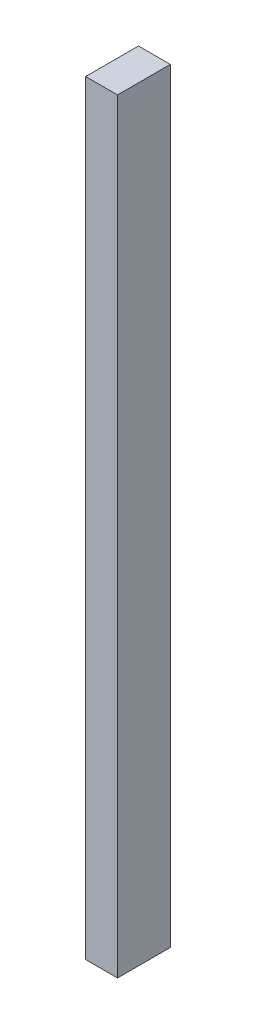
ISO-10303-21;
HEADER;
FILE_DESCRIPTION(('STEP AP214'),'2;1');
FILE_NAME('part.step','',(''),(''),'','','');
FILE_SCHEMA(('AUTOMOTIVE_DESIGN { 1 0 10303 214 1 1 1 1 }'));
ENDSEC;
DATA;
#1=APPLICATION_CONTEXT('core data for automotive mechanical design processes');
#2=APPLICATION_PROTOCOL_DEFINITION('international standard','automotive_design',2000,#1);
#3=PRODUCT_CONTEXT('',#1,'mechanical');
#4=PRODUCT('Part','Part','',(#3));
#5=PRODUCT_RELATED_PRODUCT_CATEGORY('part','',(#4));
#6=PRODUCT_DEFINITION_FORMATION('','',#4);
#7=PRODUCT_DEFINITION_CONTEXT('part definition',#1,'design');
#8=PRODUCT_DEFINITION('design','',#6,#7);
#9=PRODUCT_DEFINITION_SHAPE('','',#8);
#10=(LENGTH_UNIT() NAMED_UNIT(*) SI_UNIT(.MILLI.,.METRE.));
#11=(NAMED_UNIT(*) PLANE_ANGLE_UNIT() SI_UNIT($,.RADIAN.));
#12=(NAMED_UNIT(*) SI_UNIT($,.STERADIAN.) SOLID_ANGLE_UNIT());
#13=UNCERTAINTY_MEASURE_WITH_UNIT(LENGTH_MEASURE(1.E-05),#10,'distance_accuracy_value','');
#14=(GEOMETRIC_REPRESENTATION_CONTEXT(3) GLOBAL_UNCERTAINTY_ASSIGNED_CONTEXT((#13)) GLOBAL_UNIT_ASSIGNED_CONTEXT((#10,
#11,#12)) REPRESENTATION_CONTEXT('',''));
#15=CARTESIAN_POINT('',(0.,0.,0.));
#16=DIRECTION('',(0.,0.,1.));
#17=DIRECTION('',(1.,0.,0.));
#18=AXIS2_PLACEMENT_3D('',#15,#16,#17);
#19=CARTESIAN_POINT('',(0.,0.,63.));
#20=DIRECTION('',(1.,0.,0.));
#21=DIRECTION('',(0.,0.,-1.));
#22=AXIS2_PLACEMENT_3D('',#19,#20,#21);
#23=PLANE('',#22);
#24=DIRECTION('',(0.,-1.,0.));
#25=VECTOR('',#24,1.);
#26=CARTESIAN_POINT('',(0.,0.,0.));
#27=LINE('',#26,#25);
#28=CARTESIAN_POINT('',(0.,912.,0.));
#29=VERTEX_POINT('',#28);
#30=CARTESIAN_POINT('',(0.,0.,0.));
#31=VERTEX_POINT('',#30);
#32=EDGE_CURVE('E96',#29,#31,#27,.T.);
#33=ORIENTED_EDGE('',*,*,#32,.T.);
#34=DIRECTION('',(0.,0.,-1.));
#35=VECTOR('',#34,1.);
#36=CARTESIAN_POINT('',(0.,0.,63.));
#37=LINE('',#36,#35);
#38=CARTESIAN_POINT('',(0.,0.,63.));
#39=VERTEX_POINT('',#38);
#40=EDGE_CURVE('E11',#39,#31,#37,.T.);
#41=ORIENTED_EDGE('',*,*,#40,.F.);
#42=DIRECTION('',(0.,-1.,0.));
#43=VECTOR('',#42,1.);
#44=CARTESIAN_POINT('',(0.,0.,63.));
#45=LINE('',#44,#43);
#46=CARTESIAN_POINT('',(0.,912.,63.));
#47=VERTEX_POINT('',#46);
#48=EDGE_CURVE('E84',#47,#39,#45,.T.);
#49=ORIENTED_EDGE('',*,*,#48,.F.);
#50=DIRECTION('',(0.,0.,-1.));
#51=VECTOR('',#50,1.);
#52=CARTESIAN_POINT('',(0.,912.,63.));
#53=LINE('',#52,#51);
#54=EDGE_CURVE('E92',#47,#29,#53,.T.);
#55=ORIENTED_EDGE('',*,*,#54,.T.);
#56=EDGE_LOOP('',(#33,#41,#49,#55));
#57=FACE_BOUND('',#56,.T.);
#58=ADVANCED_FACE('F33',(#57),#23,.F.);
#59=CARTESIAN_POINT('',(0.,0.,63.));
#60=DIRECTION('',(0.,1.,0.));
#61=DIRECTION('',(0.,0.,1.));
#62=AXIS2_PLACEMENT_3D('',#59,#60,#61);
#63=PLANE('',#62);
#64=DIRECTION('',(1.,0.,0.));
#65=VECTOR('',#64,1.);
#66=CARTESIAN_POINT('',(0.,0.,0.));
#67=LINE('',#66,#65);
#68=CARTESIAN_POINT('',(38.,0.,0.));
#69=VERTEX_POINT('',#68);
#70=EDGE_CURVE('E88',#31,#69,#67,.T.);
#71=ORIENTED_EDGE('',*,*,#70,.T.);
#72=DIRECTION('',(0.,0.,-1.));
#73=VECTOR('',#72,1.);
#74=CARTESIAN_POINT('',(38.,0.,63.));
#75=LINE('',#74,#73);
#76=CARTESIAN_POINT('',(38.,0.,63.));
#77=VERTEX_POINT('',#76);
#78=EDGE_CURVE('E41',#77,#69,#75,.T.);
#79=ORIENTED_EDGE('',*,*,#78,.F.);
#80=DIRECTION('',(1.,0.,0.));
#81=VECTOR('',#80,1.);
#82=CARTESIAN_POINT('',(0.,0.,63.));
#83=LINE('',#82,#81);
#84=EDGE_CURVE('E79',#39,#77,#83,.T.);
#85=ORIENTED_EDGE('',*,*,#84,.F.);
#86=ORIENTED_EDGE('',*,*,#40,.T.);
#87=EDGE_LOOP('',(#71,#79,#85,#86));
#88=FACE_BOUND('',#87,.T.);
#89=ADVANCED_FACE('F87',(#88),#63,.F.);
#90=CARTESIAN_POINT('',(38.,0.,63.));
#91=DIRECTION('',(-1.,0.,0.));
#92=DIRECTION('',(0.,0.,1.));
#93=AXIS2_PLACEMENT_3D('',#90,#91,#92);
#94=PLANE('',#93);
#95=DIRECTION('',(0.,1.,0.));
#96=VECTOR('',#95,1.);
#97=CARTESIAN_POINT('',(38.,0.,0.));
#98=LINE('',#97,#96);
#99=CARTESIAN_POINT('',(38.,912.,0.));
#100=VERTEX_POINT('',#99);
#101=EDGE_CURVE('E66',#69,#100,#98,.T.);
#102=ORIENTED_EDGE('',*,*,#101,.T.);
#103=DIRECTION('',(0.,0.,-1.));
#104=VECTOR('',#103,1.);
#105=CARTESIAN_POINT('',(38.,912.,63.));
#106=LINE('',#105,#104);
#107=CARTESIAN_POINT('',(38.,912.,63.));
#108=VERTEX_POINT('',#107);
#109=EDGE_CURVE('E89',#108,#100,#106,.T.);
#110=ORIENTED_EDGE('',*,*,#109,.F.);
#111=DIRECTION('',(0.,1.,0.));
#112=VECTOR('',#111,1.);
#113=CARTESIAN_POINT('',(38.,0.,63.));
#114=LINE('',#113,#112);
#115=EDGE_CURVE('E82',#77,#108,#114,.T.);
#116=ORIENTED_EDGE('',*,*,#115,.F.);
#117=ORIENTED_EDGE('',*,*,#78,.T.);
#118=EDGE_LOOP('',(#102,#110,#116,#117));
#119=FACE_BOUND('',#118,.T.);
#120=ADVANCED_FACE('F90',(#119),#94,.F.);
#121=CARTESIAN_POINT('',(0.,912.,63.));
#122=DIRECTION('',(0.,-1.,0.));
#123=DIRECTION('',(1.,0.,0.));
#124=AXIS2_PLACEMENT_3D('',#121,#122,#123);
#125=PLANE('',#124);
#126=DIRECTION('',(-1.,0.,0.));
#127=VECTOR('',#126,1.);
#128=CARTESIAN_POINT('',(0.,912.,0.));
#129=LINE('',#128,#127);
#130=EDGE_CURVE('E72',#100,#29,#129,.T.);
#131=ORIENTED_EDGE('',*,*,#130,.T.);
#132=ORIENTED_EDGE('',*,*,#54,.F.);
#133=DIRECTION('',(-1.,0.,0.));
#134=VECTOR('',#133,1.);
#135=CARTESIAN_POINT('',(0.,912.,63.));
#136=LINE('',#135,#134);
#137=EDGE_CURVE('E49',#108,#47,#136,.T.);
#138=ORIENTED_EDGE('',*,*,#137,.F.);
#139=ORIENTED_EDGE('',*,*,#109,.T.);
#140=EDGE_LOOP('',(#131,#132,#138,#139));
#141=FACE_BOUND('',#140,.T.);
#142=ADVANCED_FACE('F103',(#141),#125,.F.);
#143=CARTESIAN_POINT('',(0.,0.,63.));
#144=DIRECTION('',(0.,0.,-1.));
#145=DIRECTION('',(-1.,0.,0.));
#146=AXIS2_PLACEMENT_3D('',#143,#144,#145);
#147=PLANE('',#146);
#148=ORIENTED_EDGE('',*,*,#48,.T.);
#149=ORIENTED_EDGE('',*,*,#84,.T.);
#150=ORIENTED_EDGE('',*,*,#115,.T.);
#151=ORIENTED_EDGE('',*,*,#137,.T.);
#152=EDGE_LOOP('',(#148,#149,#150,#151));
#153=FACE_BOUND('',#152,.T.);
#154=ADVANCED_FACE('F80',(#153),#147,.F.);
#155=CARTESIAN_POINT('',(0.,0.,0.));
#156=DIRECTION('',(0.,0.,-1.));
#157=DIRECTION('',(-1.,0.,0.));
#158=AXIS2_PLACEMENT_3D('',#155,#156,#157);
#159=PLANE('',#158);
#160=ORIENTED_EDGE('',*,*,#32,.F.);
#161=ORIENTED_EDGE('',*,*,#130,.F.);
#162=ORIENTED_EDGE('',*,*,#101,.F.);
#163=ORIENTED_EDGE('',*,*,#70,.F.);
#164=EDGE_LOOP('',(#160,#161,#162,#163));
#165=FACE_BOUND('',#164,.T.);
#166=ADVANCED_FACE('F106',(#165),#159,.T.);
#167=CLOSED_SHELL('',(#58,#89,#120,#142,#154,#166));
#168=MANIFOLD_SOLID_BREP('B2',#167);
#169=ADVANCED_BREP_SHAPE_REPRESENTATION('',(#18,#168),#14);
#170=SHAPE_DEFINITION_REPRESENTATION(#9,#169);
ENDSEC;
END-ISO-10303-21;
